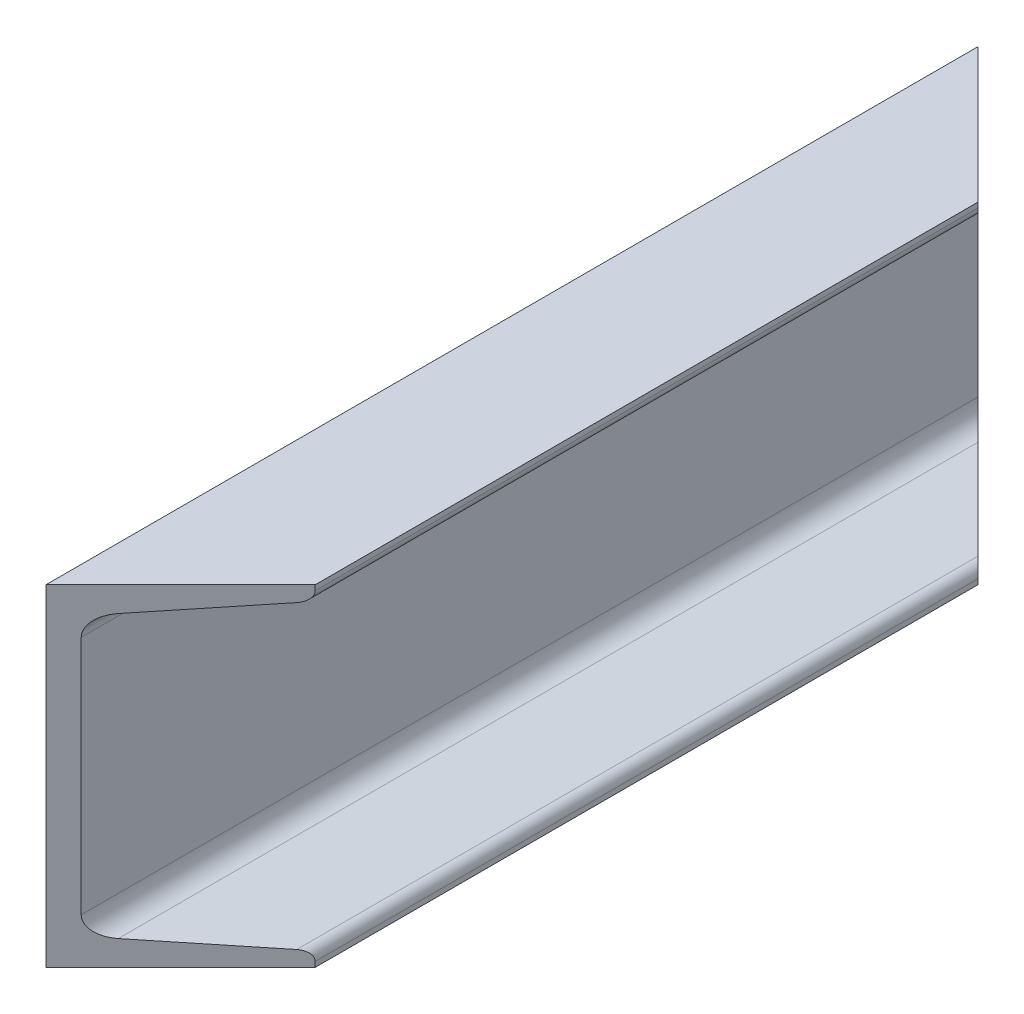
from build123d import *

# Parameters (mm, degrees)
EXTRUDE_1_DEPTH     = 225
CUT_EXTRUDE_1_DEPTH = 500


with BuildPart() as part:
    # Sketch 1 → Extrude 1 (new, symmetric)
    with BuildSketch(Plane.XY):
        with BuildLine():
            Line((0, 80), (0, -80))
            Line((0, -80), (65, -80))
            Line((65, -80), (65, -77.497140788))
            ThreePointArc((65, -77.497140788), (63.717527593, -74.153491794), (60.528004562, -72.52509783))
            Line((60.528004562, -72.52509783), (17.443990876, -67.949804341))
            ThreePointArc((17.443990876, -67.949804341), (11.064944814, -64.693016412), (8.5, -58.005718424))
            Line((8.5, -58.005718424), (8.5, 58.005718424))
            ThreePointArc((8.5, 58.005718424), (11.064944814, 64.693016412), (17.443990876, 67.949804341))
            Line((17.443990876, 67.949804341), (60.528004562, 72.52509783))
            ThreePointArc((60.528004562, 72.52509783), (63.717527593, 74.153491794), (65, 77.497140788))
            Line((65, 77.497140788), (65, 80))
            Line((65, 80), (0, 80))
        make_face()
    extrude(amount=EXTRUDE_1_DEPTH, both=True)

    # Sketch 2 → Cut-Extrude 1 (cut)
    with BuildSketch(Plane(origin=(0, 80, 0), x_dir=(-1, 0, 0), z_dir=(0, 1, 0))):
        Polygon((-65, 225), (-65, 160), (0, 225), align=None)
        Polygon((-65, -225), (-65, -160), (0, -225), align=None)
    extrude(amount=-CUT_EXTRUDE_1_DEPTH, mode=Mode.SUBTRACT)


solid = part.part
